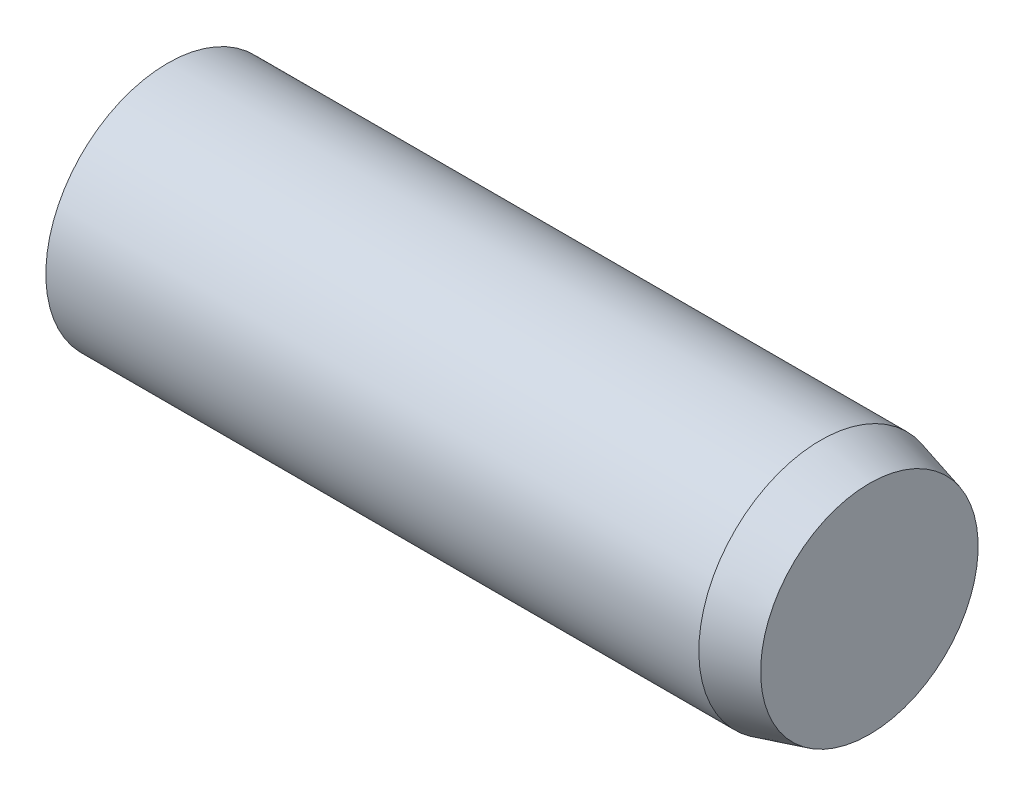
ISO-10303-21;
HEADER;
FILE_DESCRIPTION(('STEP AP214'),'2;1');
FILE_NAME('part.step','',(''),(''),'','','');
FILE_SCHEMA(('AUTOMOTIVE_DESIGN { 1 0 10303 214 1 1 1 1 }'));
ENDSEC;
DATA;
#1=APPLICATION_CONTEXT('core data for automotive mechanical design processes');
#2=APPLICATION_PROTOCOL_DEFINITION('international standard','automotive_design',2000,#1);
#3=PRODUCT_CONTEXT('',#1,'mechanical');
#4=PRODUCT('Part','Part','',(#3));
#5=PRODUCT_RELATED_PRODUCT_CATEGORY('part','',(#4));
#6=PRODUCT_DEFINITION_FORMATION('','',#4);
#7=PRODUCT_DEFINITION_CONTEXT('part definition',#1,'design');
#8=PRODUCT_DEFINITION('design','',#6,#7);
#9=PRODUCT_DEFINITION_SHAPE('','',#8);
#10=(LENGTH_UNIT() NAMED_UNIT(*) SI_UNIT(.MILLI.,.METRE.));
#11=(NAMED_UNIT(*) PLANE_ANGLE_UNIT() SI_UNIT($,.RADIAN.));
#12=(NAMED_UNIT(*) SI_UNIT($,.STERADIAN.) SOLID_ANGLE_UNIT());
#13=UNCERTAINTY_MEASURE_WITH_UNIT(LENGTH_MEASURE(1.E-05),#10,'distance_accuracy_value','');
#14=(GEOMETRIC_REPRESENTATION_CONTEXT(3) GLOBAL_UNCERTAINTY_ASSIGNED_CONTEXT((#13)) GLOBAL_UNIT_ASSIGNED_CONTEXT((#10,
#11,#12)) REPRESENTATION_CONTEXT('',''));
#15=CARTESIAN_POINT('',(0.,0.,0.));
#16=DIRECTION('',(0.,0.,1.));
#17=DIRECTION('',(1.,0.,0.));
#18=AXIS2_PLACEMENT_3D('',#15,#16,#17);
#19=CARTESIAN_POINT('',(30.,4.46410161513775,0.));
#20=DIRECTION('',(-1.,0.,0.));
#21=DIRECTION('',(0.,-1.,0.));
#22=AXIS2_PLACEMENT_3D('',#19,#20,#21);
#23=PLANE('',#22);
#24=CARTESIAN_POINT('',(30.,0.,0.));
#25=DIRECTION('',(-1.,0.,0.));
#26=DIRECTION('',(0.,-1.,0.));
#27=AXIS2_PLACEMENT_3D('',#24,#25,#26);
#28=CIRCLE('',#27,4.46410161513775);
#29=CARTESIAN_POINT('',(30.,-4.46410161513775,0.));
#30=VERTEX_POINT('',#29);
#31=EDGE_CURVE('E10',#30,#30,#28,.T.);
#32=ORIENTED_EDGE('',*,*,#31,.F.);
#33=EDGE_LOOP('',(#32));
#34=FACE_BOUND('',#33,.T.);
#35=ADVANCED_FACE('F30',(#34),#23,.F.);
#36=CARTESIAN_POINT('',(30.,0.,0.));
#37=DIRECTION('',(-1.,0.,0.));
#38=DIRECTION('',(0.,-1.,0.));
#39=AXIS2_PLACEMENT_3D('',#36,#37,#38);
#40=CONICAL_SURFACE('',#39,4.46410161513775,0.26179938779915);
#41=CARTESIAN_POINT('',(28.,0.,0.));
#42=DIRECTION('',(-1.,0.,0.));
#43=DIRECTION('',(0.,-1.,0.));
#44=AXIS2_PLACEMENT_3D('',#41,#42,#43);
#45=CIRCLE('',#44,5.);
#46=CARTESIAN_POINT('',(28.,-5.,0.));
#47=VERTEX_POINT('',#46);
#48=EDGE_CURVE('E36',#47,#47,#45,.T.);
#49=ORIENTED_EDGE('',*,*,#48,.F.);
#50=EDGE_LOOP('',(#49));
#51=FACE_BOUND('',#50,.T.);
#52=ORIENTED_EDGE('',*,*,#31,.T.);
#53=EDGE_LOOP('',(#52));
#54=FACE_BOUND('',#53,.T.);
#55=ADVANCED_FACE('F51',(#51,#54),#40,.T.);
#56=CARTESIAN_POINT('',(0.,0.,0.));
#57=DIRECTION('',(-1.,0.,0.));
#58=DIRECTION('',(0.,-1.,0.));
#59=AXIS2_PLACEMENT_3D('',#56,#57,#58);
#60=CYLINDRICAL_SURFACE('',#59,5.);
#61=CARTESIAN_POINT('',(1.2,0.,0.));
#62=DIRECTION('',(-1.,0.,0.));
#63=DIRECTION('',(0.,-1.,0.));
#64=AXIS2_PLACEMENT_3D('',#61,#62,#63);
#65=CIRCLE('',#64,5.);
#66=CARTESIAN_POINT('',(1.2,-5.,0.));
#67=VERTEX_POINT('',#66);
#68=EDGE_CURVE('E40',#67,#67,#65,.T.);
#69=ORIENTED_EDGE('',*,*,#68,.F.);
#70=EDGE_LOOP('',(#69));
#71=FACE_BOUND('',#70,.T.);
#72=ORIENTED_EDGE('',*,*,#48,.T.);
#73=EDGE_LOOP('',(#72));
#74=FACE_BOUND('',#73,.T.);
#75=ADVANCED_FACE('F49',(#71,#74),#60,.T.);
#76=CARTESIAN_POINT('',(11.0166666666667,0.,0.));
#77=DIRECTION('',(-1.,0.,0.));
#78=DIRECTION('',(0.,1.,0.));
#79=AXIS2_PLACEMENT_3D('',#76,#77,#78);
#80=SPHERICAL_SURFACE('',#79,11.0166666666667);
#81=ORIENTED_EDGE('',*,*,#68,.T.);
#82=EDGE_LOOP('',(#81));
#83=FACE_BOUND('',#82,.T.);
#84=ADVANCED_FACE('F47',(#83),#80,.T.);
#85=CLOSED_SHELL('',(#35,#55,#75,#84));
#86=MANIFOLD_SOLID_BREP('B2',#85);
#87=ADVANCED_BREP_SHAPE_REPRESENTATION('',(#18,#86),#14);
#88=SHAPE_DEFINITION_REPRESENTATION(#9,#87);
ENDSEC;
END-ISO-10303-21;
